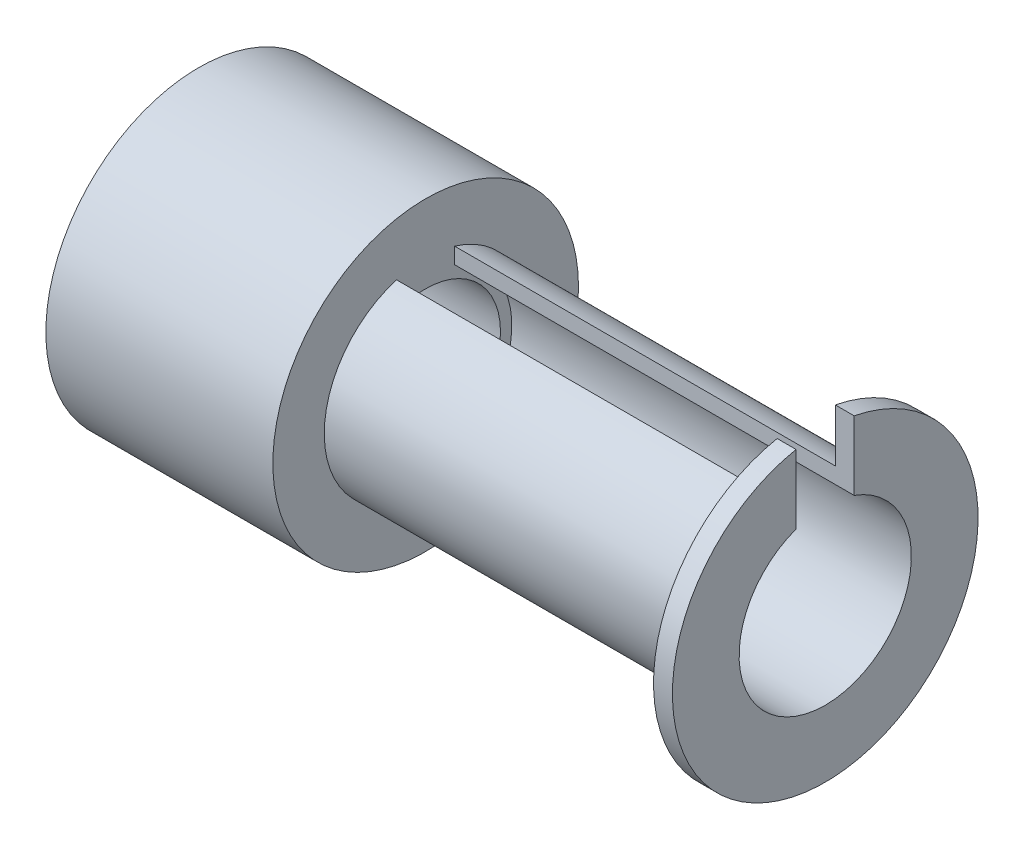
ISO-10303-21;
HEADER;
FILE_DESCRIPTION(('STEP AP214'),'2;1');
FILE_NAME('part.step','',(''),(''),'','','');
FILE_SCHEMA(('AUTOMOTIVE_DESIGN { 1 0 10303 214 1 1 1 1 }'));
ENDSEC;
DATA;
#1=APPLICATION_CONTEXT('core data for automotive mechanical design processes');
#2=APPLICATION_PROTOCOL_DEFINITION('international standard','automotive_design',2000,#1);
#3=PRODUCT_CONTEXT('',#1,'mechanical');
#4=PRODUCT('Part','Part','',(#3));
#5=PRODUCT_RELATED_PRODUCT_CATEGORY('part','',(#4));
#6=PRODUCT_DEFINITION_FORMATION('','',#4);
#7=PRODUCT_DEFINITION_CONTEXT('part definition',#1,'design');
#8=PRODUCT_DEFINITION('design','',#6,#7);
#9=PRODUCT_DEFINITION_SHAPE('','',#8);
#10=(LENGTH_UNIT() NAMED_UNIT(*) SI_UNIT(.MILLI.,.METRE.));
#11=(NAMED_UNIT(*) PLANE_ANGLE_UNIT() SI_UNIT($,.RADIAN.));
#12=(NAMED_UNIT(*) SI_UNIT($,.STERADIAN.) SOLID_ANGLE_UNIT());
#13=UNCERTAINTY_MEASURE_WITH_UNIT(LENGTH_MEASURE(1.E-05),#10,'distance_accuracy_value','');
#14=(GEOMETRIC_REPRESENTATION_CONTEXT(3) GLOBAL_UNCERTAINTY_ASSIGNED_CONTEXT((#13)) GLOBAL_UNIT_ASSIGNED_CONTEXT((#10,
#11,#12)) REPRESENTATION_CONTEXT('',''));
#15=CARTESIAN_POINT('',(0.,0.,0.));
#16=DIRECTION('',(0.,0.,1.));
#17=DIRECTION('',(1.,0.,0.));
#18=AXIS2_PLACEMENT_3D('',#15,#16,#17);
#19=CARTESIAN_POINT('',(36.5252,0.,0.));
#20=DIRECTION('',(-1.,0.,0.));
#21=DIRECTION('',(0.,0.,1.));
#22=AXIS2_PLACEMENT_3D('',#19,#20,#21);
#23=CYLINDRICAL_SURFACE('',#22,9.271);
#24=CARTESIAN_POINT('',(34.798,0.,0.));
#25=DIRECTION('',(1.,0.,0.));
#26=DIRECTION('',(0.,0.,-1.));
#27=AXIS2_PLACEMENT_3D('',#24,#25,#26);
#28=CIRCLE('',#27,9.271);
#29=CARTESIAN_POINT('',(34.798,8.87886909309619,2.66779396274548));
#30=VERTEX_POINT('',#29);
#31=CARTESIAN_POINT('',(34.798,8.88523074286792,-2.64652898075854));
#32=VERTEX_POINT('',#31);
#33=EDGE_CURVE('E144',#30,#32,#28,.T.);
#34=ORIENTED_EDGE('',*,*,#33,.F.);
#35=DIRECTION('',(-1.,0.,0.));
#36=VECTOR('',#35,1.);
#37=CARTESIAN_POINT('',(36.5252,8.87886909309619,2.66779396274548));
#38=LINE('',#37,#36);
#39=CARTESIAN_POINT('',(0.,8.87886909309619,2.66779396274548));
#40=VERTEX_POINT('',#39);
#41=EDGE_CURVE('E11',#30,#40,#38,.T.);
#42=ORIENTED_EDGE('',*,*,#41,.T.);
#43=CARTESIAN_POINT('',(0.,0.,0.));
#44=DIRECTION('',(1.,0.,0.));
#45=DIRECTION('',(0.,0.,-1.));
#46=AXIS2_PLACEMENT_3D('',#43,#44,#45);
#47=CIRCLE('',#46,9.271);
#48=CARTESIAN_POINT('',(0.,8.88523074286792,-2.64652898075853));
#49=VERTEX_POINT('',#48);
#50=EDGE_CURVE('E89',#40,#49,#47,.T.);
#51=ORIENTED_EDGE('',*,*,#50,.T.);
#52=DIRECTION('',(-1.,0.,0.));
#53=VECTOR('',#52,1.);
#54=CARTESIAN_POINT('',(36.5252,8.88523074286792,-2.64652898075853));
#55=LINE('',#54,#53);
#56=EDGE_CURVE('E43',#32,#49,#55,.T.);
#57=ORIENTED_EDGE('',*,*,#56,.F.);
#58=EDGE_LOOP('',(#34,#42,#51,#57));
#59=FACE_BOUND('',#58,.T.);
#60=ADVANCED_FACE('F34',(#59),#23,.T.);
#61=CARTESIAN_POINT('',(36.5252,0.,2.66779396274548));
#62=DIRECTION('',(0.,0.,1.));
#63=DIRECTION('',(1.,0.,0.));
#64=AXIS2_PLACEMENT_3D('',#61,#62,#63);
#65=PLANE('',#64);
#66=DIRECTION('',(-1.,0.,0.));
#67=VECTOR('',#66,1.);
#68=CARTESIAN_POINT('',(36.5252,7.40828936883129,2.66779396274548));
#69=LINE('',#68,#67);
#70=CARTESIAN_POINT('',(36.5252,7.40828936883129,2.66779396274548));
#71=VERTEX_POINT('',#70);
#72=CARTESIAN_POINT('',(0.,7.40828936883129,2.66779396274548));
#73=VERTEX_POINT('',#72);
#74=EDGE_CURVE('E51',#71,#73,#69,.T.);
#75=ORIENTED_EDGE('',*,*,#74,.T.);
#76=DIRECTION('',(0.,1.,0.));
#77=VECTOR('',#76,1.);
#78=CARTESIAN_POINT('',(0.,0.,2.66779396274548));
#79=LINE('',#78,#77);
#80=EDGE_CURVE('E70',#73,#40,#79,.T.);
#81=ORIENTED_EDGE('',*,*,#80,.T.);
#82=ORIENTED_EDGE('',*,*,#41,.F.);
#83=DIRECTION('',(0.,1.,0.));
#84=VECTOR('',#83,1.);
#85=CARTESIAN_POINT('',(34.798,0.,2.66779396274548));
#86=LINE('',#85,#84);
#87=CARTESIAN_POINT('',(34.798,13.7129054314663,2.66779396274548));
#88=VERTEX_POINT('',#87);
#89=EDGE_CURVE('E118',#30,#88,#86,.T.);
#90=ORIENTED_EDGE('',*,*,#89,.T.);
#91=DIRECTION('',(1.,0.,0.));
#92=VECTOR('',#91,1.);
#93=CARTESIAN_POINT('',(34.798,13.7129054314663,2.66779396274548));
#94=LINE('',#93,#92);
#95=CARTESIAN_POINT('',(36.5252,13.7129054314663,2.66779396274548));
#96=VERTEX_POINT('',#95);
#97=EDGE_CURVE('E120',#88,#96,#94,.T.);
#98=ORIENTED_EDGE('',*,*,#97,.T.);
#99=DIRECTION('',(0.,1.,0.));
#100=VECTOR('',#99,1.);
#101=CARTESIAN_POINT('',(36.5252,0.,2.66779396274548));
#102=LINE('',#101,#100);
#103=EDGE_CURVE('E74',#71,#96,#102,.T.);
#104=ORIENTED_EDGE('',*,*,#103,.F.);
#105=EDGE_LOOP('',(#75,#81,#82,#90,#98,#104));
#106=FACE_BOUND('',#105,.T.);
#107=ADVANCED_FACE('F36',(#106),#65,.F.);
#108=CARTESIAN_POINT('',(36.5252,0.,-2.64652898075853));
#109=DIRECTION('',(0.,0.,-1.));
#110=DIRECTION('',(-1.,0.,0.));
#111=AXIS2_PLACEMENT_3D('',#108,#109,#110);
#112=PLANE('',#111);
#113=DIRECTION('',(0.,-1.,0.));
#114=VECTOR('',#113,1.);
#115=CARTESIAN_POINT('',(36.5252,0.,-2.64652898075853));
#116=LINE('',#115,#114);
#117=CARTESIAN_POINT('',(36.5252,13.7170253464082,-2.64652898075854));
#118=VERTEX_POINT('',#117);
#119=CARTESIAN_POINT('',(36.5252,7.41591264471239,-2.64652898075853));
#120=VERTEX_POINT('',#119);
#121=EDGE_CURVE('E152',#118,#120,#116,.T.);
#122=ORIENTED_EDGE('',*,*,#121,.F.);
#123=DIRECTION('',(1.,0.,0.));
#124=VECTOR('',#123,1.);
#125=CARTESIAN_POINT('',(34.798,13.7170253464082,-2.64652898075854));
#126=LINE('',#125,#124);
#127=CARTESIAN_POINT('',(34.798,13.7170253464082,-2.64652898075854));
#128=VERTEX_POINT('',#127);
#129=EDGE_CURVE('E133',#128,#118,#126,.T.);
#130=ORIENTED_EDGE('',*,*,#129,.F.);
#131=DIRECTION('',(0.,1.,0.));
#132=VECTOR('',#131,1.);
#133=CARTESIAN_POINT('',(34.798,0.,-2.64652898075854));
#134=LINE('',#133,#132);
#135=EDGE_CURVE('E134',#32,#128,#134,.T.);
#136=ORIENTED_EDGE('',*,*,#135,.F.);
#137=ORIENTED_EDGE('',*,*,#56,.T.);
#138=DIRECTION('',(0.,-1.,0.));
#139=VECTOR('',#138,1.);
#140=CARTESIAN_POINT('',(0.,0.,-2.64652898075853));
#141=LINE('',#140,#139);
#142=CARTESIAN_POINT('',(0.,7.41591264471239,-2.64652898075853));
#143=VERTEX_POINT('',#142);
#144=EDGE_CURVE('E86',#49,#143,#141,.T.);
#145=ORIENTED_EDGE('',*,*,#144,.T.);
#146=DIRECTION('',(-1.,0.,0.));
#147=VECTOR('',#146,1.);
#148=CARTESIAN_POINT('',(36.5252,7.41591264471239,-2.64652898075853));
#149=LINE('',#148,#147);
#150=EDGE_CURVE('E76',#120,#143,#149,.T.);
#151=ORIENTED_EDGE('',*,*,#150,.F.);
#152=EDGE_LOOP('',(#122,#130,#136,#137,#145,#151));
#153=FACE_BOUND('',#152,.T.);
#154=ADVANCED_FACE('F101',(#153),#112,.F.);
#155=CARTESIAN_POINT('',(36.5252,0.,0.));
#156=DIRECTION('',(-1.,0.,0.));
#157=DIRECTION('',(0.,0.,1.));
#158=AXIS2_PLACEMENT_3D('',#155,#156,#157);
#159=CYLINDRICAL_SURFACE('',#158,7.874);
#160=ORIENTED_EDGE('',*,*,#150,.T.);
#161=CARTESIAN_POINT('',(0.,0.,0.));
#162=DIRECTION('',(1.,0.,0.));
#163=DIRECTION('',(0.,0.,-1.));
#164=AXIS2_PLACEMENT_3D('',#161,#162,#163);
#165=CIRCLE('',#164,7.874);
#166=EDGE_CURVE('E81',#73,#143,#165,.T.);
#167=ORIENTED_EDGE('',*,*,#166,.F.);
#168=ORIENTED_EDGE('',*,*,#74,.F.);
#169=CARTESIAN_POINT('',(36.5252,0.,0.));
#170=DIRECTION('',(1.,0.,0.));
#171=DIRECTION('',(0.,0.,-1.));
#172=AXIS2_PLACEMENT_3D('',#169,#170,#171);
#173=CIRCLE('',#172,7.874);
#174=EDGE_CURVE('E77',#71,#120,#173,.T.);
#175=ORIENTED_EDGE('',*,*,#174,.T.);
#176=EDGE_LOOP('',(#160,#167,#168,#175));
#177=FACE_BOUND('',#176,.T.);
#178=ADVANCED_FACE('F82',(#177),#159,.F.);
#179=CARTESIAN_POINT('',(36.5252,0.,0.));
#180=DIRECTION('',(1.,0.,0.));
#181=DIRECTION('',(0.,0.,-1.));
#182=AXIS2_PLACEMENT_3D('',#179,#180,#181);
#183=PLANE('',#182);
#184=ORIENTED_EDGE('',*,*,#103,.T.);
#185=CARTESIAN_POINT('',(36.5252,0.,0.));
#186=DIRECTION('',(1.,0.,0.));
#187=DIRECTION('',(0.,0.,-1.));
#188=AXIS2_PLACEMENT_3D('',#185,#186,#187);
#189=CIRCLE('',#188,13.97);
#190=EDGE_CURVE('E126',#96,#118,#189,.T.);
#191=ORIENTED_EDGE('',*,*,#190,.T.);
#192=ORIENTED_EDGE('',*,*,#121,.T.);
#193=ORIENTED_EDGE('',*,*,#174,.F.);
#194=EDGE_LOOP('',(#184,#191,#192,#193));
#195=FACE_BOUND('',#194,.T.);
#196=ADVANCED_FACE('F154',(#195),#183,.T.);
#197=CARTESIAN_POINT('',(0.,0.,0.));
#198=DIRECTION('',(1.,0.,0.));
#199=DIRECTION('',(0.,0.,-1.));
#200=AXIS2_PLACEMENT_3D('',#197,#198,#199);
#201=PLANE('',#200);
#202=CARTESIAN_POINT('',(0.,0.,0.));
#203=DIRECTION('',(1.,0.,0.));
#204=DIRECTION('',(0.,0.,-1.));
#205=AXIS2_PLACEMENT_3D('',#202,#203,#204);
#206=CIRCLE('',#205,6.83915930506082);
#207=CARTESIAN_POINT('',(0.,0.,-6.83915930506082));
#208=VERTEX_POINT('',#207);
#209=EDGE_CURVE('E94',#208,#208,#206,.T.);
#210=ORIENTED_EDGE('',*,*,#209,.F.);
#211=EDGE_LOOP('',(#210));
#212=FACE_BOUND('',#211,.T.);
#213=CARTESIAN_POINT('',(0.,0.,0.));
#214=DIRECTION('',(1.,0.,0.));
#215=DIRECTION('',(0.,0.,-1.));
#216=AXIS2_PLACEMENT_3D('',#213,#214,#215);
#217=CIRCLE('',#216,13.97);
#218=CARTESIAN_POINT('',(0.,0.,-13.97));
#219=VERTEX_POINT('',#218);
#220=EDGE_CURVE('E146',#219,#219,#217,.T.);
#221=ORIENTED_EDGE('',*,*,#220,.T.);
#222=EDGE_LOOP('',(#221));
#223=FACE_BOUND('',#222,.T.);
#224=ORIENTED_EDGE('',*,*,#80,.F.);
#225=ORIENTED_EDGE('',*,*,#166,.T.);
#226=ORIENTED_EDGE('',*,*,#144,.F.);
#227=ORIENTED_EDGE('',*,*,#50,.F.);
#228=EDGE_LOOP('',(#224,#225,#226,#227));
#229=FACE_BOUND('',#228,.T.);
#230=ADVANCED_FACE('F88',(#212,#223,#229),#201,.T.);
#231=CARTESIAN_POINT('',(-19.05,0.,0.));
#232=DIRECTION('',(1.,0.,0.));
#233=DIRECTION('',(0.,0.,-1.));
#234=AXIS2_PLACEMENT_3D('',#231,#232,#233);
#235=CYLINDRICAL_SURFACE('',#234,13.97);
#236=CARTESIAN_POINT('',(-20.7518,0.,0.));
#237=DIRECTION('',(-1.,0.,0.));
#238=DIRECTION('',(0.,0.,1.));
#239=AXIS2_PLACEMENT_3D('',#236,#237,#238);
#240=CIRCLE('',#239,13.97);
#241=CARTESIAN_POINT('',(-20.7518,0.,-13.97));
#242=VERTEX_POINT('',#241);
#243=EDGE_CURVE('E143',#242,#242,#240,.T.);
#244=CARTESIAN_POINT('',(0.,0.,-13.97));
#245=CARTESIAN_POINT('',(-0.216164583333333,0.,-13.97));
#246=CARTESIAN_POINT('',(-0.432329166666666,0.,-13.97));
#247=CARTESIAN_POINT('',(-0.864658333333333,0.,-13.97));
#248=CARTESIAN_POINT('',(-1.08082291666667,0.,-13.97));
#249=CARTESIAN_POINT('',(-1.51315208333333,0.,-13.97));
#250=CARTESIAN_POINT('',(-1.72931666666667,0.,-13.97));
#251=CARTESIAN_POINT('',(-2.16164583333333,0.,-13.97));
#252=CARTESIAN_POINT('',(-2.37781041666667,0.,-13.97));
#253=CARTESIAN_POINT('',(-2.81013958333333,0.,-13.97));
#254=CARTESIAN_POINT('',(-3.02630416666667,0.,-13.97));
#255=CARTESIAN_POINT('',(-3.45863333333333,0.,-13.97));
#256=CARTESIAN_POINT('',(-3.67479791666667,0.,-13.97));
#257=CARTESIAN_POINT('',(-4.10712708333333,0.,-13.97));
#258=CARTESIAN_POINT('',(-4.32329166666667,0.,-13.97));
#259=CARTESIAN_POINT('',(-4.75562083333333,0.,-13.97));
#260=CARTESIAN_POINT('',(-4.97178541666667,0.,-13.97));
#261=CARTESIAN_POINT('',(-5.40411458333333,0.,-13.97));
#262=CARTESIAN_POINT('',(-5.62027916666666,0.,-13.97));
#263=CARTESIAN_POINT('',(-6.05260833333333,0.,-13.97));
#264=CARTESIAN_POINT('',(-6.26877291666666,0.,-13.97));
#265=CARTESIAN_POINT('',(-6.70110208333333,0.,-13.97));
#266=CARTESIAN_POINT('',(-6.91726666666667,0.,-13.97));
#267=CARTESIAN_POINT('',(-7.34959583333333,0.,-13.97));
#268=CARTESIAN_POINT('',(-7.56576041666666,0.,-13.97));
#269=CARTESIAN_POINT('',(-7.99808958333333,0.,-13.97));
#270=CARTESIAN_POINT('',(-8.21425416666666,0.,-13.97));
#271=CARTESIAN_POINT('',(-8.64658333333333,0.,-13.97));
#272=CARTESIAN_POINT('',(-8.86274791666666,0.,-13.97));
#273=CARTESIAN_POINT('',(-9.29507708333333,0.,-13.97));
#274=CARTESIAN_POINT('',(-9.51124166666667,0.,-13.97));
#275=CARTESIAN_POINT('',(-9.94357083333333,0.,-13.97));
#276=CARTESIAN_POINT('',(-10.1597354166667,0.,-13.97));
#277=CARTESIAN_POINT('',(-10.5920645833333,0.,-13.97));
#278=CARTESIAN_POINT('',(-10.8082291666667,0.,-13.97));
#279=CARTESIAN_POINT('',(-11.2405583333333,0.,-13.97));
#280=CARTESIAN_POINT('',(-11.4567229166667,0.,-13.97));
#281=CARTESIAN_POINT('',(-11.8890520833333,0.,-13.97));
#282=CARTESIAN_POINT('',(-12.1052166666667,0.,-13.97));
#283=CARTESIAN_POINT('',(-12.5375458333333,0.,-13.97));
#284=CARTESIAN_POINT('',(-12.7537104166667,0.,-13.97));
#285=CARTESIAN_POINT('',(-13.1860395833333,0.,-13.97));
#286=CARTESIAN_POINT('',(-13.4022041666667,0.,-13.97));
#287=CARTESIAN_POINT('',(-13.8345333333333,0.,-13.97));
#288=CARTESIAN_POINT('',(-14.0506979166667,0.,-13.97));
#289=CARTESIAN_POINT('',(-14.4830270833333,0.,-13.97));
#290=CARTESIAN_POINT('',(-14.6991916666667,0.,-13.97));
#291=CARTESIAN_POINT('',(-15.1315208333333,0.,-13.97));
#292=CARTESIAN_POINT('',(-15.3476854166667,0.,-13.97));
#293=CARTESIAN_POINT('',(-15.7800145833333,0.,-13.97));
#294=CARTESIAN_POINT('',(-15.9961791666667,0.,-13.97));
#295=CARTESIAN_POINT('',(-16.4285083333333,0.,-13.97));
#296=CARTESIAN_POINT('',(-16.6446729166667,0.,-13.97));
#297=CARTESIAN_POINT('',(-17.0770020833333,0.,-13.97));
#298=CARTESIAN_POINT('',(-17.2931666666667,0.,-13.97));
#299=CARTESIAN_POINT('',(-17.7254958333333,0.,-13.97));
#300=CARTESIAN_POINT('',(-17.9416604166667,0.,-13.97));
#301=CARTESIAN_POINT('',(-18.3739895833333,0.,-13.97));
#302=CARTESIAN_POINT('',(-18.5901541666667,0.,-13.97));
#303=CARTESIAN_POINT('',(-19.0224833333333,0.,-13.97));
#304=CARTESIAN_POINT('',(-19.2386479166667,0.,-13.97));
#305=CARTESIAN_POINT('',(-19.6709770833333,0.,-13.97));
#306=CARTESIAN_POINT('',(-19.8871416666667,0.,-13.97));
#307=CARTESIAN_POINT('',(-20.3194708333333,0.,-13.97));
#308=CARTESIAN_POINT('',(-20.5356354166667,0.,-13.97));
#309=CARTESIAN_POINT('',(-20.7518,0.,-13.97));
#310=B_SPLINE_CURVE_WITH_KNOTS('',3,(#244,#245,#246,#247,#248,#249,#250,#251,#252,#253,#254,
#255,#256,#257,#258,#259,#260,#261,#262,#263,#264,#265,#266,#267,#268,#269,#270,#271,#272,#273,
#274,#275,#276,#277,#278,#279,#280,#281,#282,#283,#284,#285,#286,#287,#288,#289,#290,#291,#292,
#293,#294,#295,#296,#297,#298,#299,#300,#301,#302,#303,#304,#305,#306,#307,#308,#309),
.UNSPECIFIED.,.F.,.F.,(4,2,2,2,2,2,2,2,2,2,2,2,2,2,2,2,2,2,2,2,2,2,2,2,2,2,2,2,2,2,2,2,4),(0.,
0.64849375,1.2969875,1.94548125,2.593975,3.24246875,3.8909625,4.53945625,5.18795,5.83644375,
6.4849375,7.13343125,7.781925,8.43041875,9.0789125,9.72740625,10.3759,11.02439375,11.6728875,
12.32138125,12.969875,13.61836875,14.2668625,14.91535625,15.56385,16.21234375,16.8608375,
17.50933125,18.157825,18.80631875,19.4548125,20.10330625,20.7518),.UNSPECIFIED.);
#311=EDGE_CURVE('BSEAM161',#219,#242,#310,.T.);
#312=ORIENTED_EDGE('',*,*,#220,.F.);
#313=ORIENTED_EDGE('',*,*,#243,.F.);
#314=ORIENTED_EDGE('',*,*,#311,.T.);
#315=ORIENTED_EDGE('',*,*,#311,.F.);
#316=EDGE_LOOP('',(#312,#314,#313,#315));
#317=FACE_BOUND('',#316,.T.);
#318=ADVANCED_FACE('F161',(#317),#235,.T.);
#319=CARTESIAN_POINT('',(-19.05,0.,0.));
#320=DIRECTION('',(1.,0.,0.));
#321=DIRECTION('',(0.,0.,-1.));
#322=AXIS2_PLACEMENT_3D('',#319,#320,#321);
#323=CYLINDRICAL_SURFACE('',#322,6.83915930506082);
#324=CARTESIAN_POINT('',(-19.05,0.,0.));
#325=DIRECTION('',(1.,0.,0.));
#326=DIRECTION('',(0.,0.,-1.));
#327=AXIS2_PLACEMENT_3D('',#324,#325,#326);
#328=CIRCLE('',#327,6.83915930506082);
#329=CARTESIAN_POINT('',(-19.05,0.,-6.83915930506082));
#330=VERTEX_POINT('',#329);
#331=EDGE_CURVE('E90',#330,#330,#328,.T.);
#332=CARTESIAN_POINT('',(-19.05,0.,-6.83915930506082));
#333=CARTESIAN_POINT('',(-18.8515625,0.,-6.83915930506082));
#334=CARTESIAN_POINT('',(-18.653125,0.,-6.83915930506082));
#335=CARTESIAN_POINT('',(-18.25625,0.,-6.83915930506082));
#336=CARTESIAN_POINT('',(-18.0578125,0.,-6.83915930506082));
#337=CARTESIAN_POINT('',(-17.6609375,0.,-6.83915930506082));
#338=CARTESIAN_POINT('',(-17.4625,0.,-6.83915930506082));
#339=CARTESIAN_POINT('',(-17.065625,0.,-6.83915930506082));
#340=CARTESIAN_POINT('',(-16.8671875,0.,-6.83915930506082));
#341=CARTESIAN_POINT('',(-16.4703125,0.,-6.83915930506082));
#342=CARTESIAN_POINT('',(-16.271875,0.,-6.83915930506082));
#343=CARTESIAN_POINT('',(-15.875,0.,-6.83915930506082));
#344=CARTESIAN_POINT('',(-15.6765625,0.,-6.83915930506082));
#345=CARTESIAN_POINT('',(-15.2796875,0.,-6.83915930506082));
#346=CARTESIAN_POINT('',(-15.08125,0.,-6.83915930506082));
#347=CARTESIAN_POINT('',(-14.684375,0.,-6.83915930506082));
#348=CARTESIAN_POINT('',(-14.4859375,0.,-6.83915930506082));
#349=CARTESIAN_POINT('',(-14.0890625,0.,-6.83915930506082));
#350=CARTESIAN_POINT('',(-13.890625,0.,-6.83915930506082));
#351=CARTESIAN_POINT('',(-13.49375,0.,-6.83915930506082));
#352=CARTESIAN_POINT('',(-13.2953125,0.,-6.83915930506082));
#353=CARTESIAN_POINT('',(-12.8984375,0.,-6.83915930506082));
#354=CARTESIAN_POINT('',(-12.7,0.,-6.83915930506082));
#355=CARTESIAN_POINT('',(-12.303125,0.,-6.83915930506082));
#356=CARTESIAN_POINT('',(-12.1046875,0.,-6.83915930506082));
#357=CARTESIAN_POINT('',(-11.7078125,0.,-6.83915930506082));
#358=CARTESIAN_POINT('',(-11.509375,0.,-6.83915930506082));
#359=CARTESIAN_POINT('',(-11.1125,0.,-6.83915930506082));
#360=CARTESIAN_POINT('',(-10.9140625,0.,-6.83915930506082));
#361=CARTESIAN_POINT('',(-10.5171875,0.,-6.83915930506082));
#362=CARTESIAN_POINT('',(-10.31875,0.,-6.83915930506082));
#363=CARTESIAN_POINT('',(-9.921875,0.,-6.83915930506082));
#364=CARTESIAN_POINT('',(-9.7234375,0.,-6.83915930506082));
#365=CARTESIAN_POINT('',(-9.3265625,0.,-6.83915930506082));
#366=CARTESIAN_POINT('',(-9.128125,0.,-6.83915930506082));
#367=CARTESIAN_POINT('',(-8.73125,0.,-6.83915930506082));
#368=CARTESIAN_POINT('',(-8.5328125,0.,-6.83915930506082));
#369=CARTESIAN_POINT('',(-8.1359375,0.,-6.83915930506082));
#370=CARTESIAN_POINT('',(-7.9375,0.,-6.83915930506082));
#371=CARTESIAN_POINT('',(-7.540625,0.,-6.83915930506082));
#372=CARTESIAN_POINT('',(-7.3421875,0.,-6.83915930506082));
#373=CARTESIAN_POINT('',(-6.9453125,0.,-6.83915930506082));
#374=CARTESIAN_POINT('',(-6.746875,0.,-6.83915930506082));
#375=CARTESIAN_POINT('',(-6.35,0.,-6.83915930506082));
#376=CARTESIAN_POINT('',(-6.1515625,0.,-6.83915930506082));
#377=CARTESIAN_POINT('',(-5.7546875,0.,-6.83915930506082));
#378=CARTESIAN_POINT('',(-5.55625,0.,-6.83915930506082));
#379=CARTESIAN_POINT('',(-5.159375,0.,-6.83915930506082));
#380=CARTESIAN_POINT('',(-4.9609375,0.,-6.83915930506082));
#381=CARTESIAN_POINT('',(-4.5640625,0.,-6.83915930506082));
#382=CARTESIAN_POINT('',(-4.365625,0.,-6.83915930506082));
#383=CARTESIAN_POINT('',(-3.96875,0.,-6.83915930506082));
#384=CARTESIAN_POINT('',(-3.7703125,0.,-6.83915930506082));
#385=CARTESIAN_POINT('',(-3.3734375,0.,-6.83915930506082));
#386=CARTESIAN_POINT('',(-3.175,0.,-6.83915930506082));
#387=CARTESIAN_POINT('',(-2.778125,0.,-6.83915930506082));
#388=CARTESIAN_POINT('',(-2.5796875,0.,-6.83915930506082));
#389=CARTESIAN_POINT('',(-2.1828125,0.,-6.83915930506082));
#390=CARTESIAN_POINT('',(-1.984375,0.,-6.83915930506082));
#391=CARTESIAN_POINT('',(-1.5875,0.,-6.83915930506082));
#392=CARTESIAN_POINT('',(-1.3890625,0.,-6.83915930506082));
#393=CARTESIAN_POINT('',(-0.992187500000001,0.,-6.83915930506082));
#394=CARTESIAN_POINT('',(-0.793750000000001,0.,-6.83915930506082));
#395=CARTESIAN_POINT('',(-0.396875,0.,-6.83915930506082));
#396=CARTESIAN_POINT('',(-0.1984375,0.,-6.83915930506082));
#397=CARTESIAN_POINT('',(0.,0.,-6.83915930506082));
#398=B_SPLINE_CURVE_WITH_KNOTS('',3,(#332,#333,#334,#335,#336,#337,#338,#339,#340,#341,#342,
#343,#344,#345,#346,#347,#348,#349,#350,#351,#352,#353,#354,#355,#356,#357,#358,#359,#360,#361,
#362,#363,#364,#365,#366,#367,#368,#369,#370,#371,#372,#373,#374,#375,#376,#377,#378,#379,#380,
#381,#382,#383,#384,#385,#386,#387,#388,#389,#390,#391,#392,#393,#394,#395,#396,#397),
.UNSPECIFIED.,.F.,.F.,(4,2,2,2,2,2,2,2,2,2,2,2,2,2,2,2,2,2,2,2,2,2,2,2,2,2,2,2,2,2,2,2,4),(0.,
0.595312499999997,1.190625,1.7859375,2.38125,2.9765625,3.571875,4.1671875,4.7625,5.3578125,
5.953125,6.5484375,7.14375,7.7390625,8.334375,8.9296875,9.525,10.1203125,10.715625,11.3109375,
11.90625,12.5015625,13.096875,13.6921875,14.2875,14.8828125,15.478125,16.0734375,16.66875,
17.2640625,17.859375,18.4546875,19.05),.UNSPECIFIED.);
#399=EDGE_CURVE('BSEAM198',#330,#208,#398,.T.);
#400=ORIENTED_EDGE('',*,*,#331,.F.);
#401=ORIENTED_EDGE('',*,*,#209,.T.);
#402=ORIENTED_EDGE('',*,*,#399,.T.);
#403=ORIENTED_EDGE('',*,*,#399,.F.);
#404=EDGE_LOOP('',(#400,#402,#401,#403));
#405=FACE_BOUND('',#404,.T.);
#406=ADVANCED_FACE('F198',(#405),#323,.F.);
#407=CARTESIAN_POINT('',(34.798,0.,0.));
#408=DIRECTION('',(1.,0.,0.));
#409=DIRECTION('',(0.,0.,-1.));
#410=AXIS2_PLACEMENT_3D('',#407,#408,#409);
#411=PLANE('',#410);
#412=ORIENTED_EDGE('',*,*,#89,.F.);
#413=ORIENTED_EDGE('',*,*,#33,.T.);
#414=ORIENTED_EDGE('',*,*,#135,.T.);
#415=CARTESIAN_POINT('',(34.798,0.,0.));
#416=DIRECTION('',(1.,0.,0.));
#417=DIRECTION('',(0.,0.,-1.));
#418=AXIS2_PLACEMENT_3D('',#415,#416,#417);
#419=CIRCLE('',#418,13.97);
#420=EDGE_CURVE('E125',#88,#128,#419,.T.);
#421=ORIENTED_EDGE('',*,*,#420,.F.);
#422=EDGE_LOOP('',(#412,#413,#414,#421));
#423=FACE_BOUND('',#422,.T.);
#424=ADVANCED_FACE('F136',(#423),#411,.F.);
#425=CARTESIAN_POINT('',(34.798,0.,0.));
#426=DIRECTION('',(1.,0.,0.));
#427=DIRECTION('',(0.,0.,-1.));
#428=AXIS2_PLACEMENT_3D('',#425,#426,#427);
#429=CYLINDRICAL_SURFACE('',#428,13.97);
#430=ORIENTED_EDGE('',*,*,#190,.F.);
#431=ORIENTED_EDGE('',*,*,#97,.F.);
#432=ORIENTED_EDGE('',*,*,#420,.T.);
#433=ORIENTED_EDGE('',*,*,#129,.T.);
#434=EDGE_LOOP('',(#430,#431,#432,#433));
#435=FACE_BOUND('',#434,.T.);
#436=ADVANCED_FACE('F130',(#435),#429,.T.);
#437=CARTESIAN_POINT('',(-20.7518,0.,0.));
#438=DIRECTION('',(-1.,0.,0.));
#439=DIRECTION('',(0.,0.,1.));
#440=AXIS2_PLACEMENT_3D('',#437,#438,#439);
#441=PLANE('',#440);
#442=ORIENTED_EDGE('',*,*,#243,.T.);
#443=EDGE_LOOP('',(#442));
#444=FACE_BOUND('',#443,.T.);
#445=ADVANCED_FACE('F209',(#444),#441,.T.);
#446=CARTESIAN_POINT('',(-19.05,0.,0.));
#447=DIRECTION('',(-1.,0.,0.));
#448=DIRECTION('',(0.,0.,1.));
#449=AXIS2_PLACEMENT_3D('',#446,#447,#448);
#450=PLANE('',#449);
#451=ORIENTED_EDGE('',*,*,#331,.T.);
#452=EDGE_LOOP('',(#451));
#453=FACE_BOUND('',#452,.T.);
#454=ADVANCED_FACE('F227',(#453),#450,.F.);
#455=CLOSED_SHELL('',(#60,#107,#154,#178,#196,#230,#318,#406,#424,#436,#445,#454));
#456=MANIFOLD_SOLID_BREP('B2',#455);
#457=ADVANCED_BREP_SHAPE_REPRESENTATION('',(#18,#456),#14);
#458=SHAPE_DEFINITION_REPRESENTATION(#9,#457);
ENDSEC;
END-ISO-10303-21;
